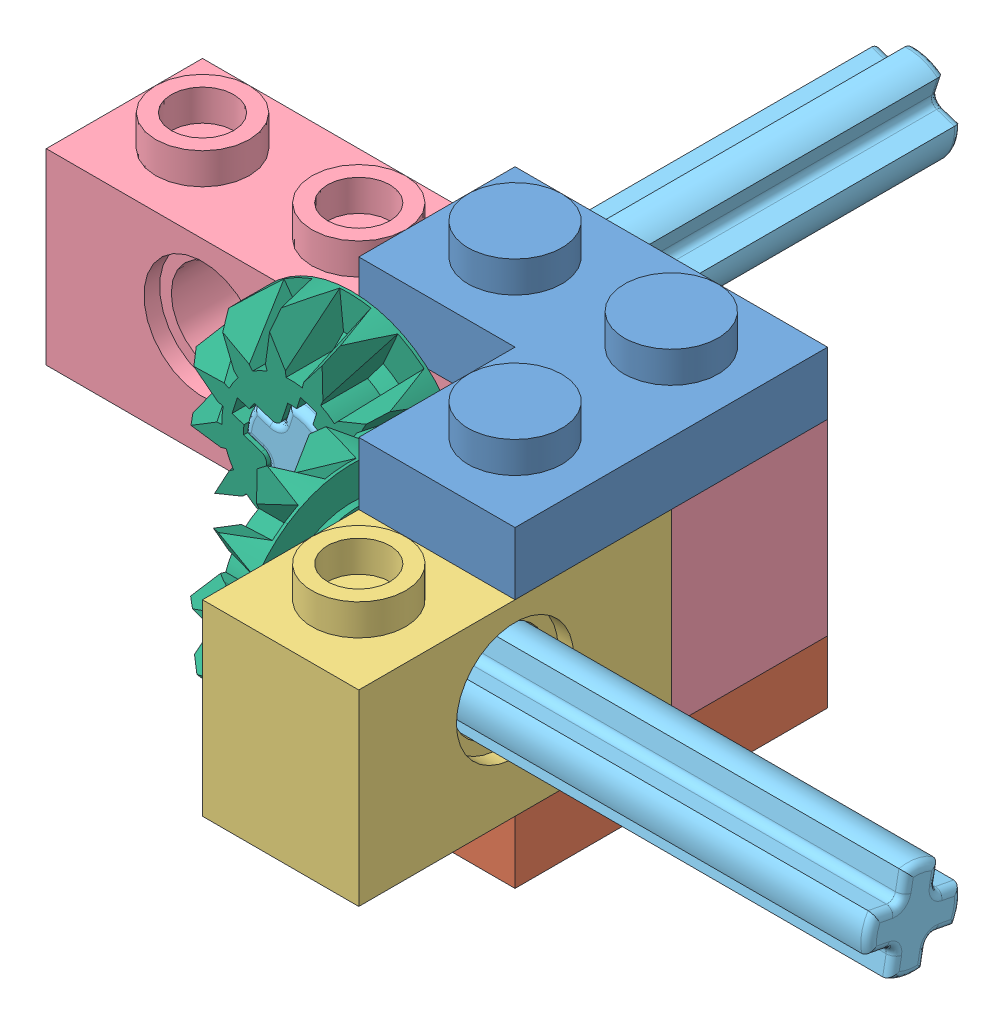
SolidWorks assembly 31.2.SLDASM, configuration Default (file format 11000). Lengths in mm.
Overall size (52.5 17.6 44.63).
8 component instances, 6 part files, 21 mates.
Components (placement in the parent):
- 2420 Plate 2 x 2 Corner - Blue-1: 2420 Plate 2 x 2 Corner - Blue.SLDPRT [Default] at (46.5707 11.9256 -0.6378) x (0 0 -1) z (1 0 0) size (16 4.8 16)
- 2420 Plate 2 x 2 Corner - Orange-1: 2420 Plate 2 x 2 Corner - Orange.SLDPRT [Default] at (46.5707 -0.8744 -0.6378) x (0 0 -1) z (1 0 0) size (16 4.8 16)
- 3700 Brick 1 x 2 with Hole-1: 3700 Brick 1 x 2 with Hole.SLDPRT [Default] at (42.5707 2.3256 -0.6378) x (0 0 1) z (-1 0 0) size (16 11.2 8)
- 3701 Brick 1 x 4 with Holes - Yellow-1: 3701 Brick 1 x 4 with Holes - Yellow.SLDPRT [Default] at (30.5707 7.1256 -12.6378) size (32 11.2 8)
- 3705 Axle 4 - Gray-1: 3705 Axle 4 - Gray.SLDPRT [Default] at (67.0707 7.9256 -0.6378) x (0 0.186272 0.982498) z (0 -0.982498 0.186272) size (4.8 32 4.8)
- 6589 Gear 12 tooth bevel - Gray-1: 6589 Gear 12 tooth bevel - Gray.SLDPRT [Default] at (34.6707 7.9256 -0.6378) x (0 0.826446 0.563017) z (-1 0 0) size (11.7 11.7 3.5)
- 6589 Gear 12 tooth bevel - Gray-2: 6589 Gear 12 tooth bevel - Gray.SLDPRT [Default] at (30.5707 7.9256 -4.7378) x (0.451049 -0.892499 0) z (0 0 1) size (11.7 11.7 3.5)
- 3705 Axle 4 - Gray-2: 3705 Axle 4 - Gray.SLDPRT [Default] at (30.5707 7.9256 -37.1378) x (0.950032 -0.312153 0) z (-0.312153 -0.950032 0) size (4.8 32 4.8)
Mates (geometry in assembly coordinates):
- Coincident3: coincident: plane of 2420 Plate 2 x 2 Corner - Orange-1 through (46.5707 -0.8744 -0.6378) normal (1 0 0); plane of 3701 Brick 1 x 4 with Holes - Yellow-1 through (46.5707 11.9256 -16.6378) normal (1 0 0)
- Coincident4: coincident: plane of 2420 Plate 2 x 2 Corner - Orange-1 through (38.5707 -0.8744 -16.6378) normal (0 0 -1); plane of 3701 Brick 1 x 4 with Holes - Yellow-1 through (30.5707 7.1256 -16.6378) normal (0 0 -1)
- Coincident5: coincident: plane of 2420 Plate 2 x 2 Corner - Orange-1 through (38.5707 2.3256 -16.6378) normal (0 1 0); plane of 3701 Brick 1 x 4 with Holes - Yellow-1 through (14.5707 2.3256 -16.6378) normal (0 -1 0)
- Coincident6: coincident: plane of 3700 Brick 1 x 2 with Hole-1 through (46.5707 11.9256 -8.6378) normal (0 0 -1); plane of 3701 Brick 1 x 4 with Holes - Yellow-1 through (30.5707 7.1256 -8.6378) normal (0 0 1)
- Coincident7: coincident: plane of 2420 Plate 2 x 2 Corner - Orange-1 through (38.5707 2.3256 -16.6378) normal (0 1 0); plane of 3700 Brick 1 x 2 with Hole-1 through (46.5707 2.3256 -8.6378) normal (0 -1 0)
- Coincident8: coincident: plane of 3700 Brick 1 x 2 with Hole-1 through (46.5707 11.9256 -8.6378) normal (0 0 -1); plane of 3701 Brick 1 x 4 with Holes - Yellow-1 through (30.5707 7.1256 -8.6378) normal (0 0 1)
- Coincident10: coincident: plane of 2420 Plate 2 x 2 Corner - Orange-1 through (46.5707 -0.8744 -0.6378) normal (1 0 0); plane of 3700 Brick 1 x 2 with Hole-1 through (46.5707 2.3256 -0.6378) normal (1 0 0)
- Coincident11: coincident: plane of 2420 Plate 2 x 2 Corner - Blue-1 through (46.5707 11.9256 -0.6378) normal (1 0 0); plane of 3701 Brick 1 x 4 with Holes - Yellow-1 through (46.5707 11.9256 -16.6378) normal (1 0 0)
- Coincident13: coincident: plane of 2420 Plate 2 x 2 Corner - Blue-1 through (38.5707 11.9256 -16.6378) normal (0 0 -1); plane of 3701 Brick 1 x 4 with Holes - Yellow-1 through (30.5707 7.1256 -16.6378) normal (0 0 -1)
- Coincident14: coincident: plane of 2420 Plate 2 x 2 Corner - Blue-1 through (38.5707 11.9256 -0.6378) normal (0 -1 0); plane of 3701 Brick 1 x 4 with Holes - Yellow-1 through (14.5707 11.9256 -16.6378) normal (0 1 0)
- Concentric1: concentric: cylinder of 3701 Brick 1 x 4 with Holes - Yellow-1 through (30.5707 7.9256 -16.6378) axis (0 0 1) radius 2.4; cylinder of 3705 Axle 4 - Gray-2 through (30.5707 7.9256 -5.1378) axis (0 0 -1) radius 2.4
- Coincident15: coincident: plane of 6589 Gear 12 tooth bevel - Gray-2 through (30.7681 6.3849 -8.6378) normal (0.745348 0.666675 0); plane of 3705 Axle 4 - Gray-2 through (30.5014 6.683 -5.1378) normal (-0.745348 -0.666675 0)
- Concentric2: concentric: cylinder of 6589 Gear 12 tooth bevel - Gray-2 through (30.5707 7.9256 -8.6378) axis (0 0 1) radius 2.4; cylinder of 3705 Axle 4 - Gray-2 through (30.5707 7.9256 -5.1378) axis (0 0 -1) radius 2.4
- Coincident16: coincident: plane of 3701 Brick 1 x 4 with Holes - Yellow-1 through (30.5707 7.1256 -8.6378) normal (0 0 1); plane of 6589 Gear 12 tooth bevel - Gray-2 through (30.5707 7.9256 -8.6378) normal (0 0 -1)
- Coincident17: coincident: plane of 6589 Gear 12 tooth bevel - Gray-2 through (30.5707 7.9256 -5.1378) normal (0 0 1); plane of 3705 Axle 4 - Gray-2 through (30.5707 7.9256 -5.1378) normal (0 0 1)
- Concentric3: concentric: cylinder of 3700 Brick 1 x 2 with Hole-1 through (46.5707 7.9256 -0.6378) axis (-1 0 0) radius 2.4; cylinder of 3705 Axle 4 - Gray-1 through (35.0707 7.9256 -0.6378) axis (1 0 0) radius 2.4
- Coincident18: coincident: plane of 3705 Axle 4 - Gray-1 through (35.0707 5.8017 -1.7555) normal (0 -0.757732 0.652566); plane of 6589 Gear 12 tooth bevel - Gray-1 through (38.5707 5.8017 -1.7555) normal (0 0.757732 -0.652566)
- Concentric4: concentric: cylinder of 3705 Axle 4 - Gray-1 through (35.0707 7.9256 -0.6378) axis (1 0 0) radius 2.4; cylinder of 6589 Gear 12 tooth bevel - Gray-1 through (38.5707 7.9256 -0.6378) axis (-1 0 0) radius 2.4
- Coincident19: coincident: plane of 3700 Brick 1 x 2 with Hole-1 through (38.5707 2.3256 -0.6378) normal (-1 0 0); plane of 6589 Gear 12 tooth bevel - Gray-1 through (38.5707 7.9256 -0.6378) normal (1 0 0)
- Coincident20: coincident: plane of 3705 Axle 4 - Gray-1 through (35.0707 7.9256 -0.6378) normal (-1 0 0); plane of 6589 Gear 12 tooth bevel - Gray-1 through (35.0707 7.9256 -0.6378) normal (-1 0 0)
- GearMate1: gear = 7 mm: circle of 6589 Gear 12 tooth bevel - Gray-2; circle of 6589 Gear 12 tooth bevel - Gray-1
